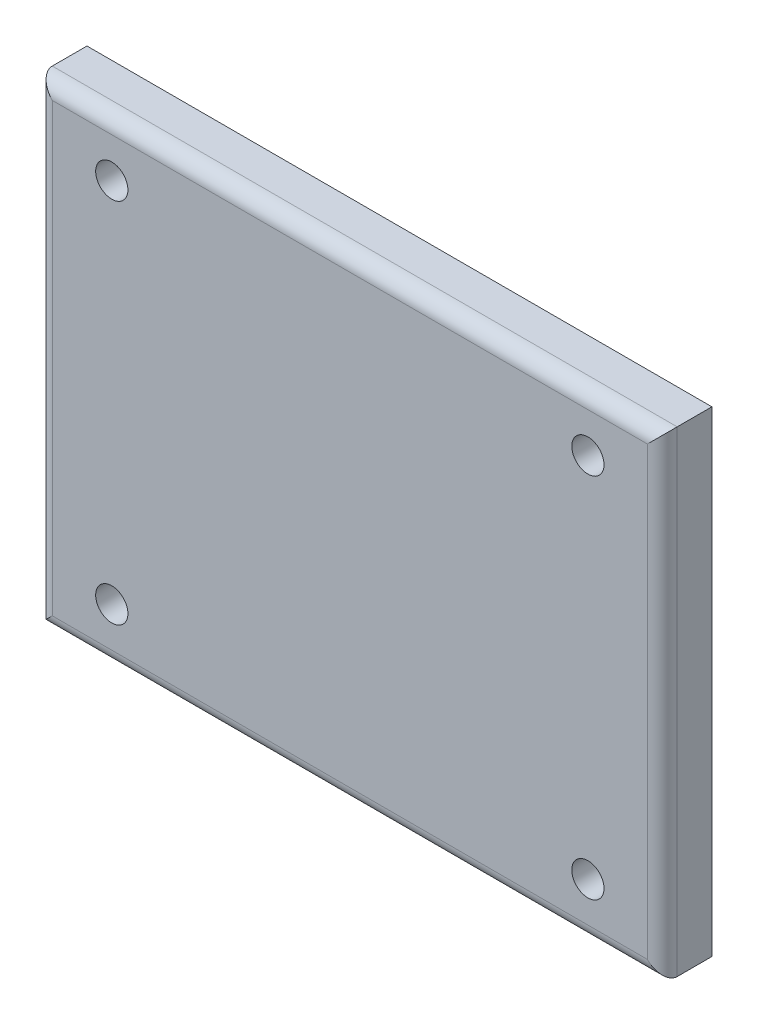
from build123d import *

# Parameters (mm, degrees)
ESQUISSE1_W                     = 126
ESQUISSE1_H                     = 96
EXTRUSION1_DEPTH                = 10
CONG_1_R                        = 3
ESQUISSE3_R                     = 3.25
ENL_V_MAT_EXTRU_1_DEPTH         = 114.035779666
R_P_TITION_LIN_AIRE1_COUNT      = 2
R_P_TITION_LIN_AIRE1_PITCH      = 96
R_P_TITION_LIN_AIRE1_COUNT_DIR2 = 2
R_P_TITION_LIN_AIRE1_PITCH_DIR2 = 74


with BuildPart() as part:
    # Esquisse1 → Extrusion1 (new body)
    with BuildSketch(Plane.XY):
        with Locations((36.06168945, 5.515130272)):
            Rectangle(ESQUISSE1_W, ESQUISSE1_H)
    extrude(amount=EXTRUSION1_DEPTH)

    # Cong_1
    cong_1_edges = [part.edges().sort_by_distance(p)[0] for p in [
        (99.06168945, 5.515130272, 10),
        (36.06168945, 53.515130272, 10),
        (-26.93831055, 5.515130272, 10),
        (36.06168945, -42.484869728, 10),
    ]]
    fillet(cong_1_edges, radius=CONG_1_R)

    # Esquisse3 → Enl_v. mat.-Extru.1 (cut, through all)
    with BuildSketch(Plane.XY.offset(10)):
        with Locations((-11.93831055, 42.515130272)):
            Circle(ESQUISSE3_R)
    enl_v_mat_extru_1 = extrude(amount=-ENL_V_MAT_EXTRU_1_DEPTH, mode=Mode.SUBTRACT)

    # R_p_tition lin_aire1: Enl_v. mat.-Extru.1 2 × 2
    with Locations(*[(i * R_P_TITION_LIN_AIRE1_PITCH, -j * R_P_TITION_LIN_AIRE1_PITCH_DIR2, 0) for i in range(R_P_TITION_LIN_AIRE1_COUNT) for j in range(R_P_TITION_LIN_AIRE1_COUNT_DIR2) if (i, j) != (0, 0)]):
        add(enl_v_mat_extru_1, mode=Mode.SUBTRACT)


solid = part.part
